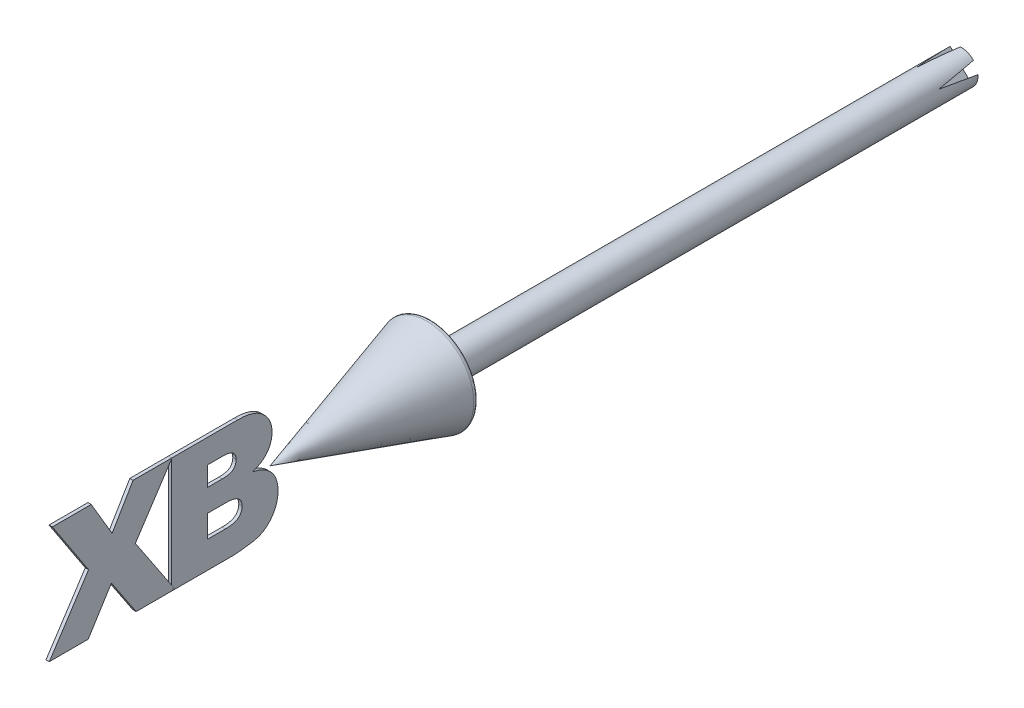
from build123d import *

# Parameters (mm, degrees)
FILLET1_R          = 1
EXTRUDE_X_DEPTH    = 0.5
EXTRUDE_B_DEPTH    = 0.5
CUT_EXTRUDE1_DEPTH = 269.84640065
CIRPATTERN1_COUNT  = 4


with BuildPart() as part:
    # Sketch1 → Revolve1 (revolve)
    with BuildSketch(Plane(origin=(0, 0, 0), x_dir=(0, 0, -1), z_dir=(1, 0, 0)), mode=Mode.PRIVATE) as revolve1_sk:
        Polygon((-200, 0), (10, 0), (10, -5), (-155.773502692, -5), (-150, -15), align=None)
    revolve(revolve1_sk.sketch.rotate(Axis((0, 0, 200), (0, 0, 1)), 180), axis=Axis((0, 0, 200), (0, 0, 1)))

    # Fillet1
    fillet1_edges = [part.edges().sort_by_distance(p)[0] for p in [
        (0, -15, 150),
    ]]
    fillet(fillet1_edges, radius=FILLET1_R)

    # Sketch26 → Cut-Extrude1 (cut, through all)
    with BuildSketch(Plane(origin=(-1.039304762, 1.039304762, -0.220911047), x_dir=(0.6666795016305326, 0.7129078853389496, 0.2174874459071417), z_dir=(0.6992527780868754, -0.6992527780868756, 0.14863076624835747))):
        Polygon((-10.88821277, -32.158941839), (-1.20382422, -34.342289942), (2.224725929, 1.720185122), align=None)
    cut_extrude1 = extrude(amount=-CUT_EXTRUDE1_DEPTH, mode=Mode.SUBTRACT)

    # CirPattern1: Cut-Extrude1 ×4 about axis
    cirpattern1_axis = Axis((0, 0, 0), (0, 0, 1))
    for i in range(1, CIRPATTERN1_COUNT):
        add(cut_extrude1.rotate(cirpattern1_axis, i * 360 / CIRPATTERN1_COUNT), mode=Mode.SUBTRACT)


with BuildPart() as body_2:
    # Sketch10 → Extrude X (new, symmetric)
    with BuildSketch(Plane(origin=(0, 0, 0), x_dir=(0, 0, -1), z_dir=(1, 0, 0))):
        Polygon((-266.636363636, 17.5), (-254.818181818, 17.5), (-248.46875, 6.732954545), (-242.090909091, 17.5), (-230.272727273, 17.5), (-241.394886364, 0.546875), (-229.363636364, -17.5), (-241.181818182, -17.5), (-248.681818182, -6.257102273), (-255.727272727, -17.5), (-267.545454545, -17.5), (-255.620738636, 0.738636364), align=None)
    extrude(amount=EXTRUDE_X_DEPTH, both=True)


with BuildPart() as body_3:
    # Sketch19 → Extrude B (new, symmetric)
    with BuildSketch(Plane(origin=(0, 0, 0), x_dir=(0, 0, -1), z_dir=(1, 0, 0))):
        with BuildLine():
            Line((-230.363636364, 17.5), (-210.299715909, 17.5))
            add(Edge.make_bspline(
                [(-210.299715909, 17.5), (-209.892231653, 17.494192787), (-209.101606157, 17.482925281), (-207.952462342, 17.36709121), (-206.875857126, 17.178354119), (-205.873219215, 16.908545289), (-204.941499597, 16.568504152), (-204.083579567, 16.148345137), (-203.298774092, 15.648779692), (-202.588537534, 15.080104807), (-201.958357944, 14.458181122), (-201.411765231, 13.790585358), (-200.952563, 13.085828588), (-200.559359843, 12.351260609), (-200.271363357, 11.573232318), (-200.064953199, 10.761330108), (-199.93227264, 9.914380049), (-199.916897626, 9.335248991), (-199.909090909, 9.041193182)],
                knots=[0, 0, 0, 0, 1.297654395, 2.517787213, 3.674586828, 4.77585146, 5.820915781, 6.829339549, 7.812606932, 8.77836667, 9.72223708, 10.627980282, 11.521109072, 12.398141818, 13.276373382, 14.156157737, 15.063782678, 16, 16, 16, 16], degree=3))
            add(Edge.make_bspline(
                [(-199.909090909, 9.041193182), (-199.913787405, 8.794669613), (-199.923034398, 8.309286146), (-200.019225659, 7.593686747), (-200.173260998, 6.903363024), (-200.396452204, 6.241310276), (-200.672642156, 5.604350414), (-201.016575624, 4.99836148), (-201.423385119, 4.417782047), (-201.737981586, 4.059678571), (-201.897727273, 3.877840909)],
                knots=[0, 0, 0, 0, 1.04282744, 2.053236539, 3.049839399, 4.032084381, 5.005705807, 5.983802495, 6.976215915, 8, 8, 8, 8], degree=3))
            add(Edge.make_bspline(
                [(-201.897727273, 3.877840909), (-202.136953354, 3.642120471), (-202.633078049, 3.153266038), (-203.550736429, 2.55869324), (-204.603828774, 2.020541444), (-205.37869969, 1.747474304), (-205.782670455, 1.605113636)],
                knots=[0, 0, 0, 0, 0.884375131, 1.834082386, 2.870821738, 4, 4, 4, 4], degree=3))
            add(Edge.make_bspline(
                [(-205.782670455, 1.605113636), (-205.462142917, 1.523322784), (-204.839819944, 1.364521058), (-203.944803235, 1.075381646), (-203.120709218, 0.728843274), (-202.352431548, 0.361252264), (-201.657010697, -0.065249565), (-201.02277228, -0.525459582), (-200.450358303, -1.028751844), (-199.953517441, -1.582596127), (-199.506475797, -2.164961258), (-199.134251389, -2.793319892), (-198.808892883, -3.451798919), (-198.547906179, -4.149583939), (-198.341962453, -4.883802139), (-198.191749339, -5.652991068), (-198.10694181, -6.458771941), (-198.096321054, -7.007380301), (-198.090909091, -7.286931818)],
                knots=[0, 0, 0, 0, 1.232819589, 2.393591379, 3.501302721, 4.562821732, 5.564607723, 6.537052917, 7.480854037, 8.39906542, 9.306143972, 10.212578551, 11.116260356, 12.040556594, 12.984728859, 13.955531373, 14.958210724, 16, 16, 16, 16], degree=3))
            add(Edge.make_bspline(
                [(-198.090909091, -7.286931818), (-198.105207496, -7.742523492), (-198.133184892, -8.633970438), (-198.37432871, -9.936142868), (-198.772918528, -11.166201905), (-199.329753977, -12.317067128), (-200.016068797, -13.375591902), (-200.828273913, -14.322768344), (-201.753408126, -15.158965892), (-202.454235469, -15.606043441), (-202.806818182, -15.830965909)],
                knots=[0, 0, 0, 0, 1.069033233, 2.091755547, 3.097262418, 4.096727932, 5.085032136, 6.050930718, 7.019433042, 8, 8, 8, 8], degree=3))
            add(Edge.make_bspline(
                [(-202.806818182, -15.830965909), (-203.059431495, -15.963560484), (-203.604881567, -16.249862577), (-204.556924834, -16.551964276), (-205.668707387, -16.826305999), (-206.474895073, -16.946072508), (-206.904829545, -17.009943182)],
                knots=[0, 0, 0, 0, 0.796985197, 1.720873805, 2.784557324, 4, 4, 4, 4], degree=3))
            add(Edge.make_bspline(
                [(-206.904829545, -17.009943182), (-207.195985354, -17.048104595), (-207.752089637, -17.120992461), (-208.547527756, -17.220751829), (-209.267253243, -17.305635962), (-209.908313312, -17.380118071), (-210.475026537, -17.425168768), (-210.964295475, -17.473559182), (-211.379075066, -17.494055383), (-211.63019682, -17.498174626), (-211.741477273, -17.5)],
                knots=[0, 0, 0, 0, 1.448973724, 2.76752333, 3.95568902, 5.025137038, 5.951619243, 6.760708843, 7.450828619, 8, 8, 8, 8], degree=3))
            Line((-211.741477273, -17.5), (-230.363636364, -17.5))
            Line((-230.363636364, -17.5), (-230.363636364, 17.5))
        make_face()
        with BuildLine():
            Line((-219.454545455, 4.318181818), (-215.044034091, 4.318181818))
            add(Edge.make_bspline(
                [(-215.044034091, 4.318181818), (-214.854574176, 4.321176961), (-214.489519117, 4.32694806), (-213.963424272, 4.363262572), (-213.481254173, 4.41634344), (-213.043593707, 4.500340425), (-212.655942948, 4.615780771), (-212.307908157, 4.74049072), (-212.006020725, 4.897083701), (-211.668961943, 5.141191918), (-211.323579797, 5.512092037), (-211.027459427, 6.045724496), (-210.844279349, 6.664432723), (-210.827149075, 7.105670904), (-210.818181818, 7.336647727)],
                knots=[0, 0, 0, 0, 1.145480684, 2.207134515, 3.187201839, 4.077092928, 4.897001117, 5.630796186, 6.309468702, 6.945115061, 8.140144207, 9.338597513, 10.606824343, 12, 12, 12, 12], degree=3))
            add(Edge.make_bspline(
                [(-210.818181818, 7.336647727), (-210.827262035, 7.553474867), (-210.844673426, 7.969242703), (-211.028645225, 8.553135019), (-211.32864811, 9.057556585), (-211.746281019, 9.494124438), (-212.322255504, 9.836294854), (-213.06177619, 10.067441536), (-213.966676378, 10.202692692), (-214.62447065, 10.218646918), (-214.980113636, 10.227272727)],
                knots=[0, 0, 0, 0, 0.898975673, 1.7237933, 2.513644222, 3.320957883, 4.208713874, 5.266782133, 6.522258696, 8, 8, 8, 8], degree=3))
            Line((-214.980113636, 10.227272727), (-219.454545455, 10.227272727))
            Line((-219.454545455, 10.227272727), (-219.454545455, 4.318181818))
        make_face(mode=Mode.SUBTRACT)
        with BuildLine():
            Line((-219.454545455, -9.318181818), (-214.014204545, -9.318181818))
            add(Edge.make_bspline(
                [(-214.014204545, -9.318181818), (-213.793982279, -9.315413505), (-213.367304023, -9.310049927), (-212.75263587, -9.270365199), (-212.188024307, -9.19212056), (-211.676632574, -9.083813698), (-211.212111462, -8.962759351), (-210.800423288, -8.796178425), (-210.440621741, -8.600116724), (-210.031719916, -8.306020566), (-209.614533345, -7.872216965), (-209.257719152, -7.25491433), (-209.035656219, -6.556035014), (-209.012180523, -6.059952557), (-209, -5.802556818)],
                knots=[0, 0, 0, 0, 1.137803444, 2.204481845, 3.180101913, 4.079687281, 4.904664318, 5.65648604, 6.368130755, 7.016521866, 8.253609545, 9.443098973, 10.673334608, 12, 12, 12, 12], degree=3))
            add(Edge.make_bspline(
                [(-209, -5.802556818), (-209.013141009, -5.564297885), (-209.038521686, -5.104122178), (-209.250782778, -4.447441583), (-209.619689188, -3.876704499), (-210.029506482, -3.464359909), (-210.431004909, -3.183783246), (-210.791655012, -2.998201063), (-211.204786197, -2.844766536), (-211.670577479, -2.71679488), (-212.188598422, -2.619815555), (-212.757899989, -2.550089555), (-213.379077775, -2.507205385), (-213.810532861, -2.502469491), (-214.035511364, -2.5)],
                knots=[0, 0, 0, 0, 1.255417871, 2.424726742, 3.592633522, 4.811599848, 5.466560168, 6.1705524, 6.945451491, 7.787981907, 8.716507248, 9.723634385, 10.813008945, 12, 12, 12, 12], degree=3))
            Line((-214.035511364, -2.5), (-219.454545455, -2.5))
            Line((-219.454545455, -2.5), (-219.454545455, -9.318181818))
        make_face(mode=Mode.SUBTRACT)
    extrude(amount=EXTRUDE_B_DEPTH, both=True)


solid = Compound([part.part, body_2.part, body_3.part])
